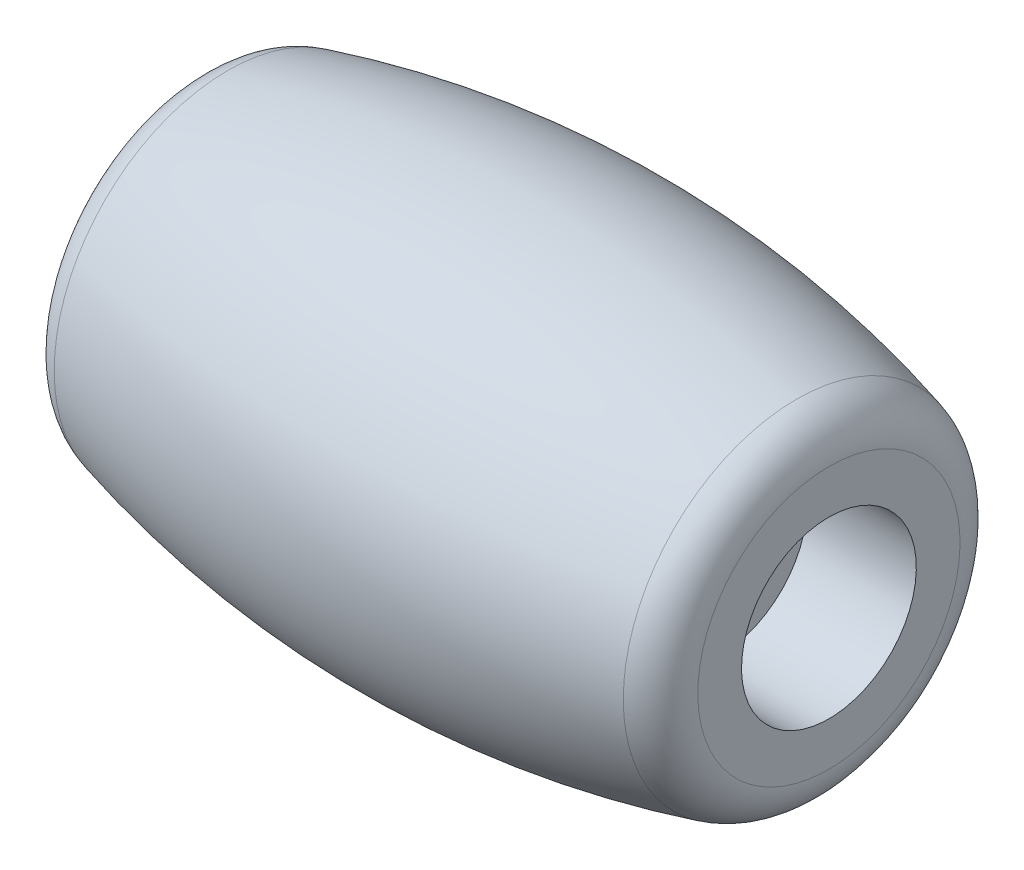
from build123d import *


with BuildPart() as part:
    # Croquis1 → Revoluci_n1 (revolve)
    with BuildSketch(Plane.XY):
        with BuildLine():
            Line((5, -3.5), (5, -5))
            Line((5, -5), (24, -5))
            Line((24, -5), (24, -3.5))
            Line((24, -3.5), (29, -3.5))
            Line((29, -3.5), (29, -1.5))
            ThreePointArc((29, -1.5), (28.58771324, -0.28379004), (27.520833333, 0.430992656))
            ThreePointArc((27.520833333, 0.430992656), (14.5, 2.156176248), (1.479166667, 0.430992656))
            ThreePointArc((1.479166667, 0.430992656), (0.41228676, -0.28379004), (0, -1.5))
            Line((0, -1.5), (0, -3.5))
            Line((0, -3.5), (5, -3.5))
        make_face()
    revolve(axis=Axis((-0.001250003, -7.5, 0), (1, 0, 0)))


solid = part.part
